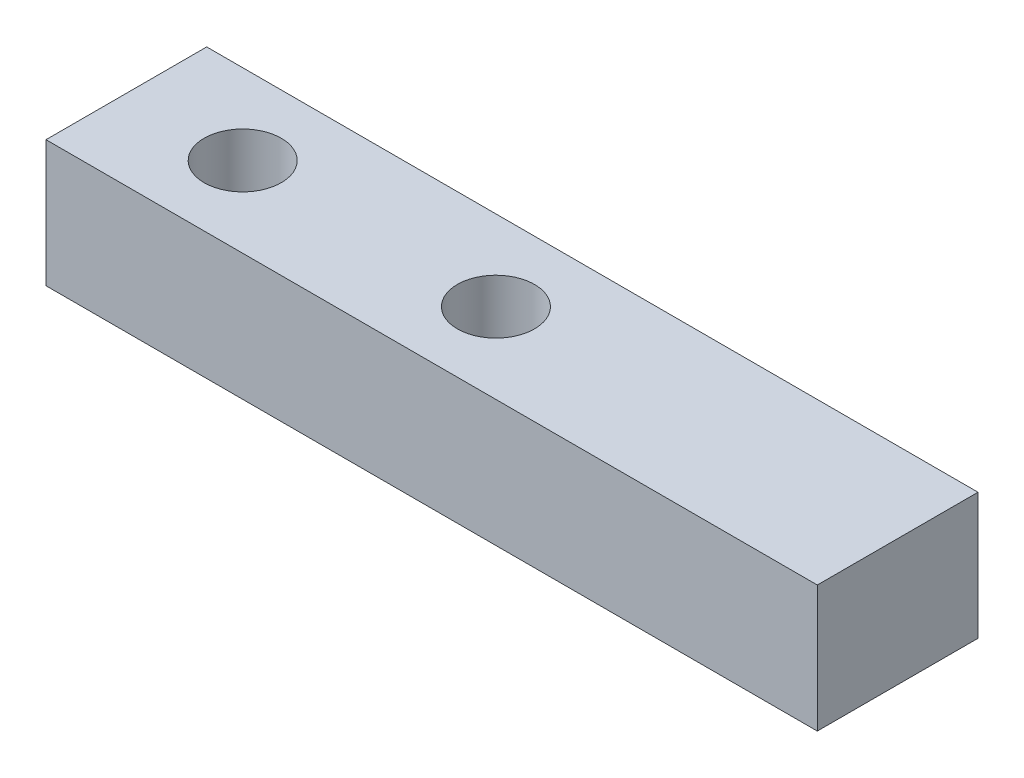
ISO-10303-21;
HEADER;
FILE_DESCRIPTION(('STEP AP214'),'2;1');
FILE_NAME('part.step','',(''),(''),'','','');
FILE_SCHEMA(('AUTOMOTIVE_DESIGN { 1 0 10303 214 1 1 1 1 }'));
ENDSEC;
DATA;
#1=APPLICATION_CONTEXT('core data for automotive mechanical design processes');
#2=APPLICATION_PROTOCOL_DEFINITION('international standard','automotive_design',2000,#1);
#3=PRODUCT_CONTEXT('',#1,'mechanical');
#4=PRODUCT('Part','Part','',(#3));
#5=PRODUCT_RELATED_PRODUCT_CATEGORY('part','',(#4));
#6=PRODUCT_DEFINITION_FORMATION('','',#4);
#7=PRODUCT_DEFINITION_CONTEXT('part definition',#1,'design');
#8=PRODUCT_DEFINITION('design','',#6,#7);
#9=PRODUCT_DEFINITION_SHAPE('','',#8);
#10=(LENGTH_UNIT() NAMED_UNIT(*) SI_UNIT(.MILLI.,.METRE.));
#11=(NAMED_UNIT(*) PLANE_ANGLE_UNIT() SI_UNIT($,.RADIAN.));
#12=(NAMED_UNIT(*) SI_UNIT($,.STERADIAN.) SOLID_ANGLE_UNIT());
#13=UNCERTAINTY_MEASURE_WITH_UNIT(LENGTH_MEASURE(1.E-05),#10,'distance_accuracy_value','');
#14=(GEOMETRIC_REPRESENTATION_CONTEXT(3) GLOBAL_UNCERTAINTY_ASSIGNED_CONTEXT((#13)) GLOBAL_UNIT_ASSIGNED_CONTEXT((#10,
#11,#12)) REPRESENTATION_CONTEXT('',''));
#15=CARTESIAN_POINT('',(0.,0.,0.));
#16=DIRECTION('',(0.,0.,1.));
#17=DIRECTION('',(1.,0.,0.));
#18=AXIS2_PLACEMENT_3D('',#15,#16,#17);
#19=CARTESIAN_POINT('',(30.48,2.5,-3.175));
#20=DIRECTION('',(0.,0.,1.));
#21=DIRECTION('',(0.,-1.,0.));
#22=AXIS2_PLACEMENT_3D('',#19,#20,#21);
#23=PLANE('',#22);
#24=DIRECTION('',(0.,1.,0.));
#25=VECTOR('',#24,1.);
#26=CARTESIAN_POINT('',(0.,2.5,-3.175));
#27=LINE('',#26,#25);
#28=CARTESIAN_POINT('',(0.,-2.5,-3.175));
#29=VERTEX_POINT('',#28);
#30=CARTESIAN_POINT('',(0.,2.5,-3.175));
#31=VERTEX_POINT('',#30);
#32=EDGE_CURVE('E96',#29,#31,#27,.T.);
#33=ORIENTED_EDGE('',*,*,#32,.T.);
#34=DIRECTION('',(-1.,0.,0.));
#35=VECTOR('',#34,1.);
#36=CARTESIAN_POINT('',(30.48,2.5,-3.175));
#37=LINE('',#36,#35);
#38=CARTESIAN_POINT('',(30.48,2.5,-3.175));
#39=VERTEX_POINT('',#38);
#40=EDGE_CURVE('E11',#39,#31,#37,.T.);
#41=ORIENTED_EDGE('',*,*,#40,.F.);
#42=DIRECTION('',(0.,1.,0.));
#43=VECTOR('',#42,1.);
#44=CARTESIAN_POINT('',(30.48,2.5,-3.175));
#45=LINE('',#44,#43);
#46=CARTESIAN_POINT('',(30.48,-2.5,-3.175));
#47=VERTEX_POINT('',#46);
#48=EDGE_CURVE('E84',#47,#39,#45,.T.);
#49=ORIENTED_EDGE('',*,*,#48,.F.);
#50=DIRECTION('',(-1.,0.,0.));
#51=VECTOR('',#50,1.);
#52=CARTESIAN_POINT('',(30.48,-2.5,-3.175));
#53=LINE('',#52,#51);
#54=EDGE_CURVE('E92',#47,#29,#53,.T.);
#55=ORIENTED_EDGE('',*,*,#54,.T.);
#56=EDGE_LOOP('',(#33,#41,#49,#55));
#57=FACE_BOUND('',#56,.T.);
#58=ADVANCED_FACE('F33',(#57),#23,.F.);
#59=CARTESIAN_POINT('',(30.48,2.5,3.175));
#60=DIRECTION('',(0.,-1.,0.));
#61=DIRECTION('',(0.,0.,-1.));
#62=AXIS2_PLACEMENT_3D('',#59,#60,#61);
#63=PLANE('',#62);
#64=CARTESIAN_POINT('',(4.5974,2.5,0.));
#65=DIRECTION('',(0.,1.,0.));
#66=DIRECTION('',(0.,0.,1.));
#67=AXIS2_PLACEMENT_3D('',#64,#65,#66);
#68=CIRCLE('',#67,1.524);
#69=CARTESIAN_POINT('',(4.5974,2.5,1.524));
#70=VERTEX_POINT('',#69);
#71=EDGE_CURVE('E115',#70,#70,#68,.T.);
#72=ORIENTED_EDGE('',*,*,#71,.F.);
#73=EDGE_LOOP('',(#72));
#74=FACE_BOUND('',#73,.T.);
#75=CARTESIAN_POINT('',(14.605,2.5,0.));
#76=DIRECTION('',(0.,1.,0.));
#77=DIRECTION('',(0.,0.,1.));
#78=AXIS2_PLACEMENT_3D('',#75,#76,#77);
#79=CIRCLE('',#78,1.524);
#80=CARTESIAN_POINT('',(14.605,2.5,1.524));
#81=VERTEX_POINT('',#80);
#82=EDGE_CURVE('E112',#81,#81,#79,.T.);
#83=ORIENTED_EDGE('',*,*,#82,.F.);
#84=EDGE_LOOP('',(#83));
#85=FACE_BOUND('',#84,.T.);
#86=DIRECTION('',(0.,0.,1.));
#87=VECTOR('',#86,1.);
#88=CARTESIAN_POINT('',(0.,2.5,3.175));
#89=LINE('',#88,#87);
#90=CARTESIAN_POINT('',(0.,2.5,3.175));
#91=VERTEX_POINT('',#90);
#92=EDGE_CURVE('E88',#31,#91,#89,.T.);
#93=ORIENTED_EDGE('',*,*,#92,.T.);
#94=DIRECTION('',(-1.,0.,0.));
#95=VECTOR('',#94,1.);
#96=CARTESIAN_POINT('',(30.48,2.5,3.175));
#97=LINE('',#96,#95);
#98=CARTESIAN_POINT('',(30.48,2.5,3.175));
#99=VERTEX_POINT('',#98);
#100=EDGE_CURVE('E41',#99,#91,#97,.T.);
#101=ORIENTED_EDGE('',*,*,#100,.F.);
#102=DIRECTION('',(0.,0.,1.));
#103=VECTOR('',#102,1.);
#104=CARTESIAN_POINT('',(30.48,2.5,3.175));
#105=LINE('',#104,#103);
#106=EDGE_CURVE('E79',#39,#99,#105,.T.);
#107=ORIENTED_EDGE('',*,*,#106,.F.);
#108=ORIENTED_EDGE('',*,*,#40,.T.);
#109=EDGE_LOOP('',(#93,#101,#107,#108));
#110=FACE_BOUND('',#109,.T.);
#111=ADVANCED_FACE('F87',(#74,#85,#110),#63,.F.);
#112=CARTESIAN_POINT('',(30.48,2.5,3.175));
#113=DIRECTION('',(0.,0.,-1.));
#114=DIRECTION('',(0.,1.,0.));
#115=AXIS2_PLACEMENT_3D('',#112,#113,#114);
#116=PLANE('',#115);
#117=DIRECTION('',(0.,-1.,0.));
#118=VECTOR('',#117,1.);
#119=CARTESIAN_POINT('',(0.,2.5,3.175));
#120=LINE('',#119,#118);
#121=CARTESIAN_POINT('',(0.,-2.5,3.175));
#122=VERTEX_POINT('',#121);
#123=EDGE_CURVE('E66',#91,#122,#120,.T.);
#124=ORIENTED_EDGE('',*,*,#123,.T.);
#125=DIRECTION('',(-1.,0.,0.));
#126=VECTOR('',#125,1.);
#127=CARTESIAN_POINT('',(30.48,-2.5,3.175));
#128=LINE('',#127,#126);
#129=CARTESIAN_POINT('',(30.48,-2.5,3.175));
#130=VERTEX_POINT('',#129);
#131=EDGE_CURVE('E89',#130,#122,#128,.T.);
#132=ORIENTED_EDGE('',*,*,#131,.F.);
#133=DIRECTION('',(0.,-1.,0.));
#134=VECTOR('',#133,1.);
#135=CARTESIAN_POINT('',(30.48,2.5,3.175));
#136=LINE('',#135,#134);
#137=EDGE_CURVE('E82',#99,#130,#136,.T.);
#138=ORIENTED_EDGE('',*,*,#137,.F.);
#139=ORIENTED_EDGE('',*,*,#100,.T.);
#140=EDGE_LOOP('',(#124,#132,#138,#139));
#141=FACE_BOUND('',#140,.T.);
#142=ADVANCED_FACE('F90',(#141),#116,.F.);
#143=CARTESIAN_POINT('',(30.48,-2.5,3.175));
#144=DIRECTION('',(0.,1.,0.));
#145=DIRECTION('',(0.,0.,1.));
#146=AXIS2_PLACEMENT_3D('',#143,#144,#145);
#147=PLANE('',#146);
#148=CARTESIAN_POINT('',(4.5974,-2.5,0.));
#149=DIRECTION('',(0.,1.,0.));
#150=DIRECTION('',(0.,0.,1.));
#151=AXIS2_PLACEMENT_3D('',#148,#149,#150);
#152=CIRCLE('',#151,1.524);
#153=CARTESIAN_POINT('',(4.5974,-2.5,1.524));
#154=VERTEX_POINT('',#153);
#155=EDGE_CURVE('E118',#154,#154,#152,.F.);
#156=ORIENTED_EDGE('',*,*,#155,.F.);
#157=EDGE_LOOP('',(#156));
#158=FACE_BOUND('',#157,.T.);
#159=CARTESIAN_POINT('',(14.605,-2.5,0.));
#160=DIRECTION('',(0.,1.,0.));
#161=DIRECTION('',(0.,0.,1.));
#162=AXIS2_PLACEMENT_3D('',#159,#160,#161);
#163=CIRCLE('',#162,1.524);
#164=CARTESIAN_POINT('',(14.605,-2.5,1.524));
#165=VERTEX_POINT('',#164);
#166=EDGE_CURVE('E99',#165,#165,#163,.F.);
#167=ORIENTED_EDGE('',*,*,#166,.F.);
#168=EDGE_LOOP('',(#167));
#169=FACE_BOUND('',#168,.T.);
#170=DIRECTION('',(0.,0.,-1.));
#171=VECTOR('',#170,1.);
#172=CARTESIAN_POINT('',(0.,-2.5,3.175));
#173=LINE('',#172,#171);
#174=EDGE_CURVE('E72',#122,#29,#173,.T.);
#175=ORIENTED_EDGE('',*,*,#174,.T.);
#176=ORIENTED_EDGE('',*,*,#54,.F.);
#177=DIRECTION('',(0.,0.,-1.));
#178=VECTOR('',#177,1.);
#179=CARTESIAN_POINT('',(30.48,-2.5,3.175));
#180=LINE('',#179,#178);
#181=EDGE_CURVE('E49',#130,#47,#180,.T.);
#182=ORIENTED_EDGE('',*,*,#181,.F.);
#183=ORIENTED_EDGE('',*,*,#131,.T.);
#184=EDGE_LOOP('',(#175,#176,#182,#183));
#185=FACE_BOUND('',#184,.T.);
#186=ADVANCED_FACE('F104',(#158,#169,#185),#147,.F.);
#187=CARTESIAN_POINT('',(30.48,0.,0.));
#188=DIRECTION('',(1.,0.,0.));
#189=DIRECTION('',(0.,0.,-1.));
#190=AXIS2_PLACEMENT_3D('',#187,#188,#189);
#191=PLANE('',#190);
#192=ORIENTED_EDGE('',*,*,#48,.T.);
#193=ORIENTED_EDGE('',*,*,#106,.T.);
#194=ORIENTED_EDGE('',*,*,#137,.T.);
#195=ORIENTED_EDGE('',*,*,#181,.T.);
#196=EDGE_LOOP('',(#192,#193,#194,#195));
#197=FACE_BOUND('',#196,.T.);
#198=ADVANCED_FACE('F80',(#197),#191,.T.);
#199=CARTESIAN_POINT('',(0.,0.,0.));
#200=DIRECTION('',(1.,0.,0.));
#201=DIRECTION('',(0.,0.,-1.));
#202=AXIS2_PLACEMENT_3D('',#199,#200,#201);
#203=PLANE('',#202);
#204=ORIENTED_EDGE('',*,*,#32,.F.);
#205=ORIENTED_EDGE('',*,*,#174,.F.);
#206=ORIENTED_EDGE('',*,*,#123,.F.);
#207=ORIENTED_EDGE('',*,*,#92,.F.);
#208=EDGE_LOOP('',(#204,#205,#206,#207));
#209=FACE_BOUND('',#208,.T.);
#210=ADVANCED_FACE('F107',(#209),#203,.F.);
#211=CARTESIAN_POINT('',(14.605,-2.501,0.));
#212=DIRECTION('',(0.,1.,0.));
#213=DIRECTION('',(0.,0.,1.));
#214=AXIS2_PLACEMENT_3D('',#211,#212,#213);
#215=CYLINDRICAL_SURFACE('',#214,1.524);
#216=ORIENTED_EDGE('',*,*,#82,.T.);
#217=EDGE_LOOP('',(#216));
#218=FACE_BOUND('',#217,.T.);
#219=ORIENTED_EDGE('',*,*,#166,.T.);
#220=EDGE_LOOP('',(#219));
#221=FACE_BOUND('',#220,.T.);
#222=ADVANCED_FACE('F129',(#218,#221),#215,.F.);
#223=CARTESIAN_POINT('',(4.5974,-2.501,0.));
#224=DIRECTION('',(0.,1.,0.));
#225=DIRECTION('',(0.,0.,1.));
#226=AXIS2_PLACEMENT_3D('',#223,#224,#225);
#227=CYLINDRICAL_SURFACE('',#226,1.524);
#228=ORIENTED_EDGE('',*,*,#71,.T.);
#229=EDGE_LOOP('',(#228));
#230=FACE_BOUND('',#229,.T.);
#231=ORIENTED_EDGE('',*,*,#155,.T.);
#232=EDGE_LOOP('',(#231));
#233=FACE_BOUND('',#232,.T.);
#234=ADVANCED_FACE('F122',(#230,#233),#227,.F.);
#235=CLOSED_SHELL('',(#58,#111,#142,#186,#198,#210,#222,#234));
#236=MANIFOLD_SOLID_BREP('B2',#235);
#237=ADVANCED_BREP_SHAPE_REPRESENTATION('',(#18,#236),#14);
#238=SHAPE_DEFINITION_REPRESENTATION(#9,#237);
ENDSEC;
END-ISO-10303-21;
